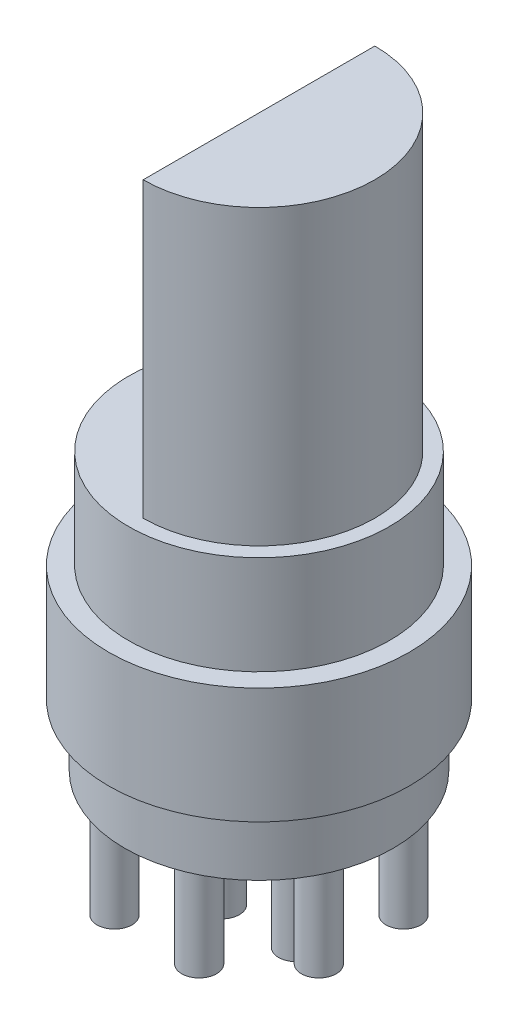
ISO-10303-21;
HEADER;
FILE_DESCRIPTION(('STEP AP214'),'2;1');
FILE_NAME('part.step','',(''),(''),'','','');
FILE_SCHEMA(('AUTOMOTIVE_DESIGN { 1 0 10303 214 1 1 1 1 }'));
ENDSEC;
DATA;
#1=APPLICATION_CONTEXT('core data for automotive mechanical design processes');
#2=APPLICATION_PROTOCOL_DEFINITION('international standard','automotive_design',2000,#1);
#3=PRODUCT_CONTEXT('',#1,'mechanical');
#4=PRODUCT('Part','Part','',(#3));
#5=PRODUCT_RELATED_PRODUCT_CATEGORY('part','',(#4));
#6=PRODUCT_DEFINITION_FORMATION('','',#4);
#7=PRODUCT_DEFINITION_CONTEXT('part definition',#1,'design');
#8=PRODUCT_DEFINITION('design','',#6,#7);
#9=PRODUCT_DEFINITION_SHAPE('','',#8);
#10=(LENGTH_UNIT() NAMED_UNIT(*) SI_UNIT(.MILLI.,.METRE.));
#11=(NAMED_UNIT(*) PLANE_ANGLE_UNIT() SI_UNIT($,.RADIAN.));
#12=(NAMED_UNIT(*) SI_UNIT($,.STERADIAN.) SOLID_ANGLE_UNIT());
#13=UNCERTAINTY_MEASURE_WITH_UNIT(LENGTH_MEASURE(1.E-05),#10,'distance_accuracy_value','');
#14=(GEOMETRIC_REPRESENTATION_CONTEXT(3) GLOBAL_UNCERTAINTY_ASSIGNED_CONTEXT((#13)) GLOBAL_UNIT_ASSIGNED_CONTEXT((#10,
#11,#12)) REPRESENTATION_CONTEXT('',''));
#15=CARTESIAN_POINT('',(0.,0.,0.));
#16=DIRECTION('',(0.,0.,1.));
#17=DIRECTION('',(1.,0.,0.));
#18=AXIS2_PLACEMENT_3D('',#15,#16,#17);
#19=CARTESIAN_POINT('',(0.,-2.1717,0.));
#20=DIRECTION('',(0.,1.,0.));
#21=DIRECTION('',(0.,0.,1.));
#22=AXIS2_PLACEMENT_3D('',#19,#20,#21);
#23=PLANE('',#22);
#24=CARTESIAN_POINT('',(-1.4798942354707,-2.1717,3.57278073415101));
#25=DIRECTION('',(0.,1.,0.));
#26=DIRECTION('',(0.,0.,1.));
#27=AXIS2_PLACEMENT_3D('',#24,#25,#26);
#28=CIRCLE('',#27,0.6096);
#29=CARTESIAN_POINT('',(-1.4798942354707,-2.1717,4.18238073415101));
#30=VERTEX_POINT('',#29);
#31=EDGE_CURVE('E11',#30,#30,#28,.F.);
#32=ORIENTED_EDGE('',*,*,#31,.F.);
#33=EDGE_LOOP('',(#32));
#34=FACE_BOUND('',#33,.T.);
#35=CARTESIAN_POINT('',(1.47989423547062,-2.1717,3.57278073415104));
#36=DIRECTION('',(0.,1.,0.));
#37=DIRECTION('',(0.,0.,1.));
#38=AXIS2_PLACEMENT_3D('',#35,#36,#37);
#39=CIRCLE('',#38,0.6096);
#40=CARTESIAN_POINT('',(1.47989423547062,-2.1717,4.18238073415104));
#41=VERTEX_POINT('',#40);
#42=EDGE_CURVE('E40',#41,#41,#39,.F.);
#43=ORIENTED_EDGE('',*,*,#42,.F.);
#44=EDGE_LOOP('',(#43));
#45=FACE_BOUND('',#44,.T.);
#46=CARTESIAN_POINT('',(3.57278073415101,-2.1717,1.47989423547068));
#47=DIRECTION('',(0.,1.,0.));
#48=DIRECTION('',(0.,0.,1.));
#49=AXIS2_PLACEMENT_3D('',#46,#47,#48);
#50=CIRCLE('',#49,0.6096);
#51=CARTESIAN_POINT('',(3.57278073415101,-2.1717,2.08949423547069));
#52=VERTEX_POINT('',#51);
#53=EDGE_CURVE('E115',#52,#52,#50,.F.);
#54=ORIENTED_EDGE('',*,*,#53,.F.);
#55=EDGE_LOOP('',(#54));
#56=FACE_BOUND('',#55,.T.);
#57=CARTESIAN_POINT('',(3.57278073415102,-2.1717,-1.47989423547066));
#58=DIRECTION('',(0.,1.,0.));
#59=DIRECTION('',(0.,0.,1.));
#60=AXIS2_PLACEMENT_3D('',#57,#58,#59);
#61=CIRCLE('',#60,0.6096);
#62=CARTESIAN_POINT('',(3.57278073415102,-2.1717,-0.87029423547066));
#63=VERTEX_POINT('',#62);
#64=EDGE_CURVE('E112',#63,#63,#61,.F.);
#65=ORIENTED_EDGE('',*,*,#64,.F.);
#66=EDGE_LOOP('',(#65));
#67=FACE_BOUND('',#66,.T.);
#68=CARTESIAN_POINT('',(1.47989423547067,-2.1717,-3.57278073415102));
#69=DIRECTION('',(0.,1.,0.));
#70=DIRECTION('',(0.,0.,1.));
#71=AXIS2_PLACEMENT_3D('',#68,#69,#70);
#72=CIRCLE('',#71,0.6096);
#73=CARTESIAN_POINT('',(1.47989423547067,-2.1717,-2.96318073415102));
#74=VERTEX_POINT('',#73);
#75=EDGE_CURVE('E109',#74,#74,#72,.F.);
#76=ORIENTED_EDGE('',*,*,#75,.F.);
#77=EDGE_LOOP('',(#76));
#78=FACE_BOUND('',#77,.T.);
#79=CARTESIAN_POINT('',(-1.47989423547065,-2.1717,-3.57278073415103));
#80=DIRECTION('',(0.,1.,0.));
#81=DIRECTION('',(0.,0.,1.));
#82=AXIS2_PLACEMENT_3D('',#79,#80,#81);
#83=CIRCLE('',#82,0.6096);
#84=CARTESIAN_POINT('',(-1.47989423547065,-2.1717,-2.96318073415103));
#85=VERTEX_POINT('',#84);
#86=EDGE_CURVE('E106',#85,#85,#83,.F.);
#87=ORIENTED_EDGE('',*,*,#86,.F.);
#88=EDGE_LOOP('',(#87));
#89=FACE_BOUND('',#88,.T.);
#90=CARTESIAN_POINT('',(-3.57278073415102,-2.1717,-1.47989423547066));
#91=DIRECTION('',(0.,1.,0.));
#92=DIRECTION('',(0.,0.,1.));
#93=AXIS2_PLACEMENT_3D('',#90,#91,#92);
#94=CIRCLE('',#93,0.6096);
#95=CARTESIAN_POINT('',(-3.57278073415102,-2.1717,-0.87029423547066));
#96=VERTEX_POINT('',#95);
#97=EDGE_CURVE('E103',#96,#96,#94,.F.);
#98=ORIENTED_EDGE('',*,*,#97,.F.);
#99=EDGE_LOOP('',(#98));
#100=FACE_BOUND('',#99,.T.);
#101=CARTESIAN_POINT('',(-3.57278073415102,-2.1717,1.47989423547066));
#102=DIRECTION('',(0.,1.,0.));
#103=DIRECTION('',(0.,0.,1.));
#104=AXIS2_PLACEMENT_3D('',#101,#102,#103);
#105=CIRCLE('',#104,0.6096);
#106=CARTESIAN_POINT('',(-3.57278073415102,-2.1717,2.08949423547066));
#107=VERTEX_POINT('',#106);
#108=EDGE_CURVE('E100',#107,#107,#105,.F.);
#109=ORIENTED_EDGE('',*,*,#108,.F.);
#110=EDGE_LOOP('',(#109));
#111=FACE_BOUND('',#110,.T.);
#112=CARTESIAN_POINT('',(1.2954,-2.1717,0.));
#113=DIRECTION('',(0.,1.,0.));
#114=DIRECTION('',(0.,0.,1.));
#115=AXIS2_PLACEMENT_3D('',#112,#113,#114);
#116=CIRCLE('',#115,0.6096);
#117=CARTESIAN_POINT('',(1.2954,-2.1717,0.6096));
#118=VERTEX_POINT('',#117);
#119=EDGE_CURVE('E97',#118,#118,#116,.F.);
#120=ORIENTED_EDGE('',*,*,#119,.F.);
#121=EDGE_LOOP('',(#120));
#122=FACE_BOUND('',#121,.T.);
#123=CARTESIAN_POINT('',(-1.2954,-2.1717,0.));
#124=DIRECTION('',(0.,1.,0.));
#125=DIRECTION('',(0.,0.,1.));
#126=AXIS2_PLACEMENT_3D('',#123,#124,#125);
#127=CIRCLE('',#126,0.6096);
#128=CARTESIAN_POINT('',(-1.2954,-2.1717,0.6096));
#129=VERTEX_POINT('',#128);
#130=EDGE_CURVE('E63',#129,#129,#127,.F.);
#131=ORIENTED_EDGE('',*,*,#130,.F.);
#132=EDGE_LOOP('',(#131));
#133=FACE_BOUND('',#132,.T.);
#134=CARTESIAN_POINT('',(0.,-2.1717,0.));
#135=DIRECTION('',(0.,-1.,0.));
#136=DIRECTION('',(0.,0.,-1.));
#137=AXIS2_PLACEMENT_3D('',#134,#135,#136);
#138=CIRCLE('',#137,4.69265);
#139=CARTESIAN_POINT('',(0.,-2.1717,-4.69265));
#140=VERTEX_POINT('',#139);
#141=EDGE_CURVE('E64',#140,#140,#138,.T.);
#142=ORIENTED_EDGE('',*,*,#141,.T.);
#143=EDGE_LOOP('',(#142));
#144=FACE_BOUND('',#143,.T.);
#145=ADVANCED_FACE('F33',(#34,#45,#56,#67,#78,#89,#100,#111,#122,#133,#144),#23,.F.);
#146=CARTESIAN_POINT('',(0.,0.,0.));
#147=DIRECTION('',(0.,-1.,0.));
#148=DIRECTION('',(0.,0.,-1.));
#149=AXIS2_PLACEMENT_3D('',#146,#147,#148);
#150=CYLINDRICAL_SURFACE('',#149,4.69265);
#151=ORIENTED_EDGE('',*,*,#141,.F.);
#152=EDGE_LOOP('',(#151));
#153=FACE_BOUND('',#152,.T.);
#154=CARTESIAN_POINT('',(0.,0.,0.));
#155=DIRECTION('',(0.,-1.,0.));
#156=DIRECTION('',(0.,0.,-1.));
#157=AXIS2_PLACEMENT_3D('',#154,#155,#156);
#158=CIRCLE('',#157,4.69265);
#159=CARTESIAN_POINT('',(0.,0.,-4.69265));
#160=VERTEX_POINT('',#159);
#161=EDGE_CURVE('E90',#160,#160,#158,.T.);
#162=ORIENTED_EDGE('',*,*,#161,.T.);
#163=EDGE_LOOP('',(#162));
#164=FACE_BOUND('',#163,.T.);
#165=ADVANCED_FACE('F124',(#153,#164),#150,.T.);
#166=CARTESIAN_POINT('',(-4.69265,0.,0.));
#167=DIRECTION('',(0.,1.,0.));
#168=DIRECTION('',(0.,0.,1.));
#169=AXIS2_PLACEMENT_3D('',#166,#167,#168);
#170=PLANE('',#169);
#171=ORIENTED_EDGE('',*,*,#161,.F.);
#172=EDGE_LOOP('',(#171));
#173=FACE_BOUND('',#172,.T.);
#174=CARTESIAN_POINT('',(0.,0.,0.));
#175=DIRECTION('',(0.,-1.,0.));
#176=DIRECTION('',(0.,0.,-1.));
#177=AXIS2_PLACEMENT_3D('',#174,#175,#176);
#178=CIRCLE('',#177,5.2578);
#179=CARTESIAN_POINT('',(0.,0.,-5.2578));
#180=VERTEX_POINT('',#179);
#181=EDGE_CURVE('E87',#180,#180,#178,.T.);
#182=ORIENTED_EDGE('',*,*,#181,.T.);
#183=EDGE_LOOP('',(#182));
#184=FACE_BOUND('',#183,.T.);
#185=ADVANCED_FACE('F146',(#173,#184),#170,.F.);
#186=CARTESIAN_POINT('',(0.,0.,0.));
#187=DIRECTION('',(0.,-1.,0.));
#188=DIRECTION('',(0.,0.,-1.));
#189=AXIS2_PLACEMENT_3D('',#186,#187,#188);
#190=CYLINDRICAL_SURFACE('',#189,5.2578);
#191=ORIENTED_EDGE('',*,*,#181,.F.);
#192=EDGE_LOOP('',(#191));
#193=FACE_BOUND('',#192,.T.);
#194=CARTESIAN_POINT('',(0.,4.0513,0.));
#195=DIRECTION('',(0.,-1.,0.));
#196=DIRECTION('',(0.,0.,-1.));
#197=AXIS2_PLACEMENT_3D('',#194,#195,#196);
#198=CIRCLE('',#197,5.2578);
#199=CARTESIAN_POINT('',(0.,4.0513,-5.2578));
#200=VERTEX_POINT('',#199);
#201=EDGE_CURVE('E84',#200,#200,#198,.T.);
#202=ORIENTED_EDGE('',*,*,#201,.T.);
#203=EDGE_LOOP('',(#202));
#204=FACE_BOUND('',#203,.T.);
#205=ADVANCED_FACE('F151',(#193,#204),#190,.T.);
#206=CARTESIAN_POINT('',(-5.2578,4.0513,0.));
#207=DIRECTION('',(0.,-1.,0.));
#208=DIRECTION('',(0.,0.,-1.));
#209=AXIS2_PLACEMENT_3D('',#206,#207,#208);
#210=PLANE('',#209);
#211=ORIENTED_EDGE('',*,*,#201,.F.);
#212=EDGE_LOOP('',(#211));
#213=FACE_BOUND('',#212,.T.);
#214=CARTESIAN_POINT('',(0.,4.0513,0.));
#215=DIRECTION('',(0.,-1.,0.));
#216=DIRECTION('',(0.,0.,-1.));
#217=AXIS2_PLACEMENT_3D('',#214,#215,#216);
#218=CIRCLE('',#217,4.5593);
#219=CARTESIAN_POINT('',(0.,4.0513,-4.5593));
#220=VERTEX_POINT('',#219);
#221=EDGE_CURVE('E81',#220,#220,#218,.T.);
#222=ORIENTED_EDGE('',*,*,#221,.T.);
#223=EDGE_LOOP('',(#222));
#224=FACE_BOUND('',#223,.T.);
#225=ADVANCED_FACE('F157',(#213,#224),#210,.F.);
#226=CARTESIAN_POINT('',(0.,0.,0.));
#227=DIRECTION('',(0.,-1.,0.));
#228=DIRECTION('',(0.,0.,-1.));
#229=AXIS2_PLACEMENT_3D('',#226,#227,#228);
#230=CYLINDRICAL_SURFACE('',#229,4.5593);
#231=ORIENTED_EDGE('',*,*,#221,.F.);
#232=EDGE_LOOP('',(#231));
#233=FACE_BOUND('',#232,.T.);
#234=CARTESIAN_POINT('',(0.,7.5057,0.));
#235=DIRECTION('',(0.,-1.,0.));
#236=DIRECTION('',(0.,0.,-1.));
#237=AXIS2_PLACEMENT_3D('',#234,#235,#236);
#238=CIRCLE('',#237,4.5593);
#239=CARTESIAN_POINT('',(0.,7.5057,-4.5593));
#240=VERTEX_POINT('',#239);
#241=EDGE_CURVE('E75',#240,#240,#238,.T.);
#242=ORIENTED_EDGE('',*,*,#241,.T.);
#243=EDGE_LOOP('',(#242));
#244=FACE_BOUND('',#243,.T.);
#245=ADVANCED_FACE('F163',(#233,#244),#230,.T.);
#246=CARTESIAN_POINT('',(-4.5593,7.5057,0.));
#247=DIRECTION('',(0.,-1.,0.));
#248=DIRECTION('',(0.,0.,-1.));
#249=AXIS2_PLACEMENT_3D('',#246,#247,#248);
#250=PLANE('',#249);
#251=DIRECTION('',(0.,0.,1.));
#252=VECTOR('',#251,1.);
#253=CARTESIAN_POINT('',(0.,7.5057,-5.2578));
#254=LINE('',#253,#252);
#255=CARTESIAN_POINT('',(0.,7.5057,-4.0513));
#256=VERTEX_POINT('',#255);
#257=CARTESIAN_POINT('',(0.,7.5057,4.0513));
#258=VERTEX_POINT('',#257);
#259=EDGE_CURVE('E52',#256,#258,#254,.T.);
#260=ORIENTED_EDGE('',*,*,#259,.F.);
#261=CARTESIAN_POINT('',(0.,7.5057,0.));
#262=DIRECTION('',(0.,-1.,0.));
#263=DIRECTION('',(0.,0.,-1.));
#264=AXIS2_PLACEMENT_3D('',#261,#262,#263);
#265=CIRCLE('',#264,4.0513);
#266=EDGE_CURVE('E71',#256,#258,#265,.T.);
#267=ORIENTED_EDGE('',*,*,#266,.T.);
#268=EDGE_LOOP('',(#260,#267));
#269=FACE_BOUND('',#268,.T.);
#270=ORIENTED_EDGE('',*,*,#241,.F.);
#271=EDGE_LOOP('',(#270));
#272=FACE_BOUND('',#271,.T.);
#273=ADVANCED_FACE('F169',(#269,#272),#250,.F.);
#274=CARTESIAN_POINT('',(0.,0.,0.));
#275=DIRECTION('',(0.,-1.,0.));
#276=DIRECTION('',(0.,0.,-1.));
#277=AXIS2_PLACEMENT_3D('',#274,#275,#276);
#278=CYLINDRICAL_SURFACE('',#277,4.0513);
#279=CARTESIAN_POINT('',(0.,17.7546,0.));
#280=DIRECTION('',(0.,-1.,0.));
#281=DIRECTION('',(0.,0.,-1.));
#282=AXIS2_PLACEMENT_3D('',#279,#280,#281);
#283=CIRCLE('',#282,4.0513);
#284=CARTESIAN_POINT('',(0.,17.7546,-4.0513));
#285=VERTEX_POINT('',#284);
#286=CARTESIAN_POINT('',(0.,17.7546,4.0513));
#287=VERTEX_POINT('',#286);
#288=EDGE_CURVE('E69',#285,#287,#283,.T.);
#289=ORIENTED_EDGE('',*,*,#288,.T.);
#290=DIRECTION('',(0.,-1.,0.));
#291=VECTOR('',#290,1.);
#292=CARTESIAN_POINT('',(0.,0.,4.0513));
#293=LINE('',#292,#291);
#294=EDGE_CURVE('E47',#287,#258,#293,.T.);
#295=ORIENTED_EDGE('',*,*,#294,.T.);
#296=ORIENTED_EDGE('',*,*,#266,.F.);
#297=DIRECTION('',(0.,-1.,0.));
#298=VECTOR('',#297,1.);
#299=CARTESIAN_POINT('',(0.,0.,-4.0513));
#300=LINE('',#299,#298);
#301=EDGE_CURVE('E59',#256,#285,#300,.F.);
#302=ORIENTED_EDGE('',*,*,#301,.T.);
#303=EDGE_LOOP('',(#289,#295,#296,#302));
#304=FACE_BOUND('',#303,.T.);
#305=ADVANCED_FACE('F68',(#304),#278,.T.);
#306=CARTESIAN_POINT('',(-4.0513,17.7546,0.));
#307=DIRECTION('',(0.,-1.,0.));
#308=DIRECTION('',(0.,0.,-1.));
#309=AXIS2_PLACEMENT_3D('',#306,#307,#308);
#310=PLANE('',#309);
#311=ORIENTED_EDGE('',*,*,#288,.F.);
#312=DIRECTION('',(0.,0.,1.));
#313=VECTOR('',#312,1.);
#314=CARTESIAN_POINT('',(0.,17.7546,0.));
#315=LINE('',#314,#313);
#316=EDGE_CURVE('E56',#285,#287,#315,.T.);
#317=ORIENTED_EDGE('',*,*,#316,.T.);
#318=EDGE_LOOP('',(#311,#317));
#319=FACE_BOUND('',#318,.T.);
#320=ADVANCED_FACE('F73',(#319),#310,.F.);
#321=CARTESIAN_POINT('',(0.,17.7546,-5.2578));
#322=DIRECTION('',(1.,0.,0.));
#323=DIRECTION('',(0.,0.,-1.));
#324=AXIS2_PLACEMENT_3D('',#321,#322,#323);
#325=PLANE('',#324);
#326=ORIENTED_EDGE('',*,*,#316,.F.);
#327=ORIENTED_EDGE('',*,*,#301,.F.);
#328=ORIENTED_EDGE('',*,*,#259,.T.);
#329=ORIENTED_EDGE('',*,*,#294,.F.);
#330=EDGE_LOOP('',(#326,#327,#328,#329));
#331=FACE_BOUND('',#330,.T.);
#332=ADVANCED_FACE('F58',(#331),#325,.F.);
#333=CARTESIAN_POINT('',(-1.2954,-6.8707,0.));
#334=DIRECTION('',(0.,1.,0.));
#335=DIRECTION('',(0.,0.,1.));
#336=AXIS2_PLACEMENT_3D('',#333,#334,#335);
#337=CYLINDRICAL_SURFACE('',#336,0.6096);
#338=CARTESIAN_POINT('',(-1.2954,-6.8707,0.));
#339=DIRECTION('',(0.,-1.,0.));
#340=DIRECTION('',(0.,0.,-1.));
#341=AXIS2_PLACEMENT_3D('',#338,#339,#340);
#342=CIRCLE('',#341,0.6096);
#343=CARTESIAN_POINT('',(-1.2954,-6.8707,-0.6096));
#344=VERTEX_POINT('',#343);
#345=EDGE_CURVE('E294',#344,#344,#342,.T.);
#346=ORIENTED_EDGE('',*,*,#345,.F.);
#347=EDGE_LOOP('',(#346));
#348=FACE_BOUND('',#347,.T.);
#349=ORIENTED_EDGE('',*,*,#130,.T.);
#350=EDGE_LOOP('',(#349));
#351=FACE_BOUND('',#350,.T.);
#352=ADVANCED_FACE('F185',(#348,#351),#337,.T.);
#353=CARTESIAN_POINT('',(-1.2954,-6.8707,0.));
#354=DIRECTION('',(0.,-1.,0.));
#355=DIRECTION('',(0.,0.,-1.));
#356=AXIS2_PLACEMENT_3D('',#353,#354,#355);
#357=PLANE('',#356);
#358=ORIENTED_EDGE('',*,*,#345,.T.);
#359=EDGE_LOOP('',(#358));
#360=FACE_BOUND('',#359,.T.);
#361=ADVANCED_FACE('F188',(#360),#357,.T.);
#362=CARTESIAN_POINT('',(1.2954,-6.8707,0.));
#363=DIRECTION('',(0.,1.,0.));
#364=DIRECTION('',(0.,0.,1.));
#365=AXIS2_PLACEMENT_3D('',#362,#363,#364);
#366=CYLINDRICAL_SURFACE('',#365,0.6096);
#367=CARTESIAN_POINT('',(1.2954,-6.8707,0.));
#368=DIRECTION('',(0.,-1.,0.));
#369=DIRECTION('',(0.,0.,-1.));
#370=AXIS2_PLACEMENT_3D('',#367,#368,#369);
#371=CIRCLE('',#370,0.6096);
#372=CARTESIAN_POINT('',(1.2954,-6.8707,-0.6096));
#373=VERTEX_POINT('',#372);
#374=EDGE_CURVE('E291',#373,#373,#371,.T.);
#375=ORIENTED_EDGE('',*,*,#374,.F.);
#376=EDGE_LOOP('',(#375));
#377=FACE_BOUND('',#376,.T.);
#378=ORIENTED_EDGE('',*,*,#119,.T.);
#379=EDGE_LOOP('',(#378));
#380=FACE_BOUND('',#379,.T.);
#381=ADVANCED_FACE('F192',(#377,#380),#366,.T.);
#382=CARTESIAN_POINT('',(1.2954,-6.8707,0.));
#383=DIRECTION('',(0.,-1.,0.));
#384=DIRECTION('',(0.,0.,-1.));
#385=AXIS2_PLACEMENT_3D('',#382,#383,#384);
#386=PLANE('',#385);
#387=ORIENTED_EDGE('',*,*,#374,.T.);
#388=EDGE_LOOP('',(#387));
#389=FACE_BOUND('',#388,.T.);
#390=ADVANCED_FACE('F196',(#389),#386,.T.);
#391=CARTESIAN_POINT('',(-3.57278073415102,-5.4864,1.47989423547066));
#392=DIRECTION('',(0.,1.,0.));
#393=DIRECTION('',(0.,0.,1.));
#394=AXIS2_PLACEMENT_3D('',#391,#392,#393);
#395=CYLINDRICAL_SURFACE('',#394,0.6096);
#396=CARTESIAN_POINT('',(-3.57278073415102,-5.4864,1.47989423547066));
#397=DIRECTION('',(0.,-1.,0.));
#398=DIRECTION('',(0.,0.,-1.));
#399=AXIS2_PLACEMENT_3D('',#396,#397,#398);
#400=CIRCLE('',#399,0.6096);
#401=CARTESIAN_POINT('',(-3.57278073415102,-5.4864,0.87029423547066));
#402=VERTEX_POINT('',#401);
#403=EDGE_CURVE('E288',#402,#402,#400,.T.);
#404=ORIENTED_EDGE('',*,*,#403,.F.);
#405=EDGE_LOOP('',(#404));
#406=FACE_BOUND('',#405,.T.);
#407=ORIENTED_EDGE('',*,*,#108,.T.);
#408=EDGE_LOOP('',(#407));
#409=FACE_BOUND('',#408,.T.);
#410=ADVANCED_FACE('F200',(#406,#409),#395,.T.);
#411=CARTESIAN_POINT('',(-3.57278073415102,-5.4864,1.47989423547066));
#412=DIRECTION('',(0.,-1.,0.));
#413=DIRECTION('',(0.,0.,-1.));
#414=AXIS2_PLACEMENT_3D('',#411,#412,#413);
#415=PLANE('',#414);
#416=ORIENTED_EDGE('',*,*,#403,.T.);
#417=EDGE_LOOP('',(#416));
#418=FACE_BOUND('',#417,.T.);
#419=ADVANCED_FACE('F204',(#418),#415,.T.);
#420=CARTESIAN_POINT('',(-3.57278073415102,-5.4864,-1.47989423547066));
#421=DIRECTION('',(0.,1.,0.));
#422=DIRECTION('',(0.,0.,1.));
#423=AXIS2_PLACEMENT_3D('',#420,#421,#422);
#424=CYLINDRICAL_SURFACE('',#423,0.6096);
#425=CARTESIAN_POINT('',(-3.57278073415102,-5.4864,-1.47989423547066));
#426=DIRECTION('',(0.,-1.,0.));
#427=DIRECTION('',(0.707106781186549,0.,-0.707106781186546));
#428=AXIS2_PLACEMENT_3D('',#425,#426,#427);
#429=CIRCLE('',#428,0.6096);
#430=CARTESIAN_POINT('',(-3.1417284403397,-5.4864,-1.91094652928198));
#431=VERTEX_POINT('',#430);
#432=EDGE_CURVE('E285',#431,#431,#429,.T.);
#433=ORIENTED_EDGE('',*,*,#432,.F.);
#434=EDGE_LOOP('',(#433));
#435=FACE_BOUND('',#434,.T.);
#436=ORIENTED_EDGE('',*,*,#97,.T.);
#437=EDGE_LOOP('',(#436));
#438=FACE_BOUND('',#437,.T.);
#439=ADVANCED_FACE('F208',(#435,#438),#424,.T.);
#440=CARTESIAN_POINT('',(-3.57278073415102,-5.4864,-1.47989423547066));
#441=DIRECTION('',(0.,-1.,0.));
#442=DIRECTION('',(0.707106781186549,0.,-0.707106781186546));
#443=AXIS2_PLACEMENT_3D('',#440,#441,#442);
#444=PLANE('',#443);
#445=ORIENTED_EDGE('',*,*,#432,.T.);
#446=EDGE_LOOP('',(#445));
#447=FACE_BOUND('',#446,.T.);
#448=ADVANCED_FACE('F212',(#447),#444,.T.);
#449=CARTESIAN_POINT('',(-1.47989423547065,-5.4864,-3.57278073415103));
#450=DIRECTION('',(0.,1.,0.));
#451=DIRECTION('',(0.,0.,1.));
#452=AXIS2_PLACEMENT_3D('',#449,#450,#451);
#453=CYLINDRICAL_SURFACE('',#452,0.6096);
#454=CARTESIAN_POINT('',(-1.47989423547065,-5.4864,-3.57278073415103));
#455=DIRECTION('',(0.,-1.,0.));
#456=DIRECTION('',(1.,0.,0.));
#457=AXIS2_PLACEMENT_3D('',#454,#455,#456);
#458=CIRCLE('',#457,0.6096);
#459=CARTESIAN_POINT('',(-0.870294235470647,-5.4864,-3.57278073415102));
#460=VERTEX_POINT('',#459);
#461=EDGE_CURVE('E282',#460,#460,#458,.T.);
#462=ORIENTED_EDGE('',*,*,#461,.F.);
#463=EDGE_LOOP('',(#462));
#464=FACE_BOUND('',#463,.T.);
#465=ORIENTED_EDGE('',*,*,#86,.T.);
#466=EDGE_LOOP('',(#465));
#467=FACE_BOUND('',#466,.T.);
#468=ADVANCED_FACE('F216',(#464,#467),#453,.T.);
#469=CARTESIAN_POINT('',(-1.47989423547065,-5.4864,-3.57278073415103));
#470=DIRECTION('',(0.,-1.,0.));
#471=DIRECTION('',(1.,0.,0.));
#472=AXIS2_PLACEMENT_3D('',#469,#470,#471);
#473=PLANE('',#472);
#474=ORIENTED_EDGE('',*,*,#461,.T.);
#475=EDGE_LOOP('',(#474));
#476=FACE_BOUND('',#475,.T.);
#477=ADVANCED_FACE('F220',(#476),#473,.T.);
#478=CARTESIAN_POINT('',(1.47989423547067,-5.4864,-3.57278073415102));
#479=DIRECTION('',(0.,1.,0.));
#480=DIRECTION('',(0.,0.,1.));
#481=AXIS2_PLACEMENT_3D('',#478,#479,#480);
#482=CYLINDRICAL_SURFACE('',#481,0.6096);
#483=CARTESIAN_POINT('',(1.47989423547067,-5.4864,-3.57278073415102));
#484=DIRECTION('',(0.,-1.,0.));
#485=DIRECTION('',(0.707106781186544,0.,0.707106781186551));
#486=AXIS2_PLACEMENT_3D('',#483,#484,#485);
#487=CIRCLE('',#486,0.6096);
#488=CARTESIAN_POINT('',(1.91094652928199,-5.4864,-3.14172844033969));
#489=VERTEX_POINT('',#488);
#490=EDGE_CURVE('E279',#489,#489,#487,.T.);
#491=ORIENTED_EDGE('',*,*,#490,.F.);
#492=EDGE_LOOP('',(#491));
#493=FACE_BOUND('',#492,.T.);
#494=ORIENTED_EDGE('',*,*,#75,.T.);
#495=EDGE_LOOP('',(#494));
#496=FACE_BOUND('',#495,.T.);
#497=ADVANCED_FACE('F224',(#493,#496),#482,.T.);
#498=CARTESIAN_POINT('',(1.47989423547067,-5.4864,-3.57278073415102));
#499=DIRECTION('',(0.,-1.,0.));
#500=DIRECTION('',(0.707106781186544,0.,0.707106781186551));
#501=AXIS2_PLACEMENT_3D('',#498,#499,#500);
#502=PLANE('',#501);
#503=ORIENTED_EDGE('',*,*,#490,.T.);
#504=EDGE_LOOP('',(#503));
#505=FACE_BOUND('',#504,.T.);
#506=ADVANCED_FACE('F228',(#505),#502,.T.);
#507=CARTESIAN_POINT('',(3.57278073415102,-5.4864,-1.47989423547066));
#508=DIRECTION('',(0.,1.,0.));
#509=DIRECTION('',(0.,0.,1.));
#510=AXIS2_PLACEMENT_3D('',#507,#508,#509);
#511=CYLINDRICAL_SURFACE('',#510,0.6096);
#512=CARTESIAN_POINT('',(3.57278073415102,-5.4864,-1.47989423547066));
#513=DIRECTION('',(0.,-1.,0.));
#514=DIRECTION('',(0.,0.,1.));
#515=AXIS2_PLACEMENT_3D('',#512,#513,#514);
#516=CIRCLE('',#515,0.6096);
#517=CARTESIAN_POINT('',(3.57278073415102,-5.4864,-0.87029423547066));
#518=VERTEX_POINT('',#517);
#519=EDGE_CURVE('E276',#518,#518,#516,.T.);
#520=ORIENTED_EDGE('',*,*,#519,.F.);
#521=EDGE_LOOP('',(#520));
#522=FACE_BOUND('',#521,.T.);
#523=ORIENTED_EDGE('',*,*,#64,.T.);
#524=EDGE_LOOP('',(#523));
#525=FACE_BOUND('',#524,.T.);
#526=ADVANCED_FACE('F232',(#522,#525),#511,.T.);
#527=CARTESIAN_POINT('',(3.57278073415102,-5.4864,-1.47989423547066));
#528=DIRECTION('',(0.,-1.,0.));
#529=DIRECTION('',(0.,0.,1.));
#530=AXIS2_PLACEMENT_3D('',#527,#528,#529);
#531=PLANE('',#530);
#532=ORIENTED_EDGE('',*,*,#519,.T.);
#533=EDGE_LOOP('',(#532));
#534=FACE_BOUND('',#533,.T.);
#535=ADVANCED_FACE('F236',(#534),#531,.T.);
#536=CARTESIAN_POINT('',(3.57278073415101,-5.4864,1.47989423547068));
#537=DIRECTION('',(0.,1.,0.));
#538=DIRECTION('',(0.,0.,1.));
#539=AXIS2_PLACEMENT_3D('',#536,#537,#538);
#540=CYLINDRICAL_SURFACE('',#539,0.6096);
#541=CARTESIAN_POINT('',(3.57278073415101,-5.4864,1.47989423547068));
#542=DIRECTION('',(0.,-1.,0.));
#543=DIRECTION('',(-0.707106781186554,0.,0.707106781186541));
#544=AXIS2_PLACEMENT_3D('',#541,#542,#543);
#545=CIRCLE('',#544,0.6096);
#546=CARTESIAN_POINT('',(3.14172844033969,-5.4864,1.910946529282));
#547=VERTEX_POINT('',#546);
#548=EDGE_CURVE('E271',#547,#547,#545,.T.);
#549=ORIENTED_EDGE('',*,*,#548,.F.);
#550=EDGE_LOOP('',(#549));
#551=FACE_BOUND('',#550,.T.);
#552=ORIENTED_EDGE('',*,*,#53,.T.);
#553=EDGE_LOOP('',(#552));
#554=FACE_BOUND('',#553,.T.);
#555=ADVANCED_FACE('F240',(#551,#554),#540,.T.);
#556=CARTESIAN_POINT('',(3.57278073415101,-5.4864,1.47989423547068));
#557=DIRECTION('',(0.,-1.,0.));
#558=DIRECTION('',(-0.707106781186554,0.,0.707106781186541));
#559=AXIS2_PLACEMENT_3D('',#556,#557,#558);
#560=PLANE('',#559);
#561=ORIENTED_EDGE('',*,*,#548,.T.);
#562=EDGE_LOOP('',(#561));
#563=FACE_BOUND('',#562,.T.);
#564=ADVANCED_FACE('F244',(#563),#560,.T.);
#565=CARTESIAN_POINT('',(1.47989423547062,-5.4864,3.57278073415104));
#566=DIRECTION('',(0.,1.,0.));
#567=DIRECTION('',(0.,0.,1.));
#568=AXIS2_PLACEMENT_3D('',#565,#566,#567);
#569=CYLINDRICAL_SURFACE('',#568,0.6096);
#570=CARTESIAN_POINT('',(1.47989423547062,-5.4864,3.57278073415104));
#571=DIRECTION('',(0.,-1.,0.));
#572=DIRECTION('',(-1.,0.,0.));
#573=AXIS2_PLACEMENT_3D('',#570,#571,#572);
#574=CIRCLE('',#573,0.6096);
#575=CARTESIAN_POINT('',(0.870294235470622,-5.4864,3.57278073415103));
#576=VERTEX_POINT('',#575);
#577=EDGE_CURVE('E268',#576,#576,#574,.T.);
#578=ORIENTED_EDGE('',*,*,#577,.F.);
#579=EDGE_LOOP('',(#578));
#580=FACE_BOUND('',#579,.T.);
#581=ORIENTED_EDGE('',*,*,#42,.T.);
#582=EDGE_LOOP('',(#581));
#583=FACE_BOUND('',#582,.T.);
#584=ADVANCED_FACE('F120',(#580,#583),#569,.T.);
#585=CARTESIAN_POINT('',(1.47989423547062,-5.4864,3.57278073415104));
#586=DIRECTION('',(0.,-1.,0.));
#587=DIRECTION('',(-1.,0.,0.));
#588=AXIS2_PLACEMENT_3D('',#585,#586,#587);
#589=PLANE('',#588);
#590=ORIENTED_EDGE('',*,*,#577,.T.);
#591=EDGE_LOOP('',(#590));
#592=FACE_BOUND('',#591,.T.);
#593=ADVANCED_FACE('F251',(#592),#589,.T.);
#594=CARTESIAN_POINT('',(-1.4798942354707,-5.4864,3.57278073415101));
#595=DIRECTION('',(0.,1.,0.));
#596=DIRECTION('',(0.,0.,1.));
#597=AXIS2_PLACEMENT_3D('',#594,#595,#596);
#598=CYLINDRICAL_SURFACE('',#597,0.6096);
#599=CARTESIAN_POINT('',(-1.4798942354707,-5.4864,3.57278073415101));
#600=DIRECTION('',(0.,-1.,0.));
#601=DIRECTION('',(-0.707106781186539,0.,-0.707106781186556));
#602=AXIS2_PLACEMENT_3D('',#599,#600,#601);
#603=CIRCLE('',#602,0.6096);
#604=CARTESIAN_POINT('',(-1.91094652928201,-5.4864,3.14172844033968));
#605=VERTEX_POINT('',#604);
#606=EDGE_CURVE('E267',#605,#605,#603,.T.);
#607=ORIENTED_EDGE('',*,*,#606,.F.);
#608=EDGE_LOOP('',(#607));
#609=FACE_BOUND('',#608,.T.);
#610=ORIENTED_EDGE('',*,*,#31,.T.);
#611=EDGE_LOOP('',(#610));
#612=FACE_BOUND('',#611,.T.);
#613=ADVANCED_FACE('F255',(#609,#612),#598,.T.);
#614=CARTESIAN_POINT('',(-1.4798942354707,-5.4864,3.57278073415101));
#615=DIRECTION('',(0.,-1.,0.));
#616=DIRECTION('',(-0.707106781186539,0.,-0.707106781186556));
#617=AXIS2_PLACEMENT_3D('',#614,#615,#616);
#618=PLANE('',#617);
#619=ORIENTED_EDGE('',*,*,#606,.T.);
#620=EDGE_LOOP('',(#619));
#621=FACE_BOUND('',#620,.T.);
#622=ADVANCED_FACE('F259',(#621),#618,.T.);
#623=CLOSED_SHELL('',(#145,#165,#185,#205,#225,#245,#273,#305,#320,#332,#352,#361,#381,#390,
#410,#419,#439,#448,#468,#477,#497,#506,#526,#535,#555,#564,#584,#593,#613,#622));
#624=MANIFOLD_SOLID_BREP('B2',#623);
#625=ADVANCED_BREP_SHAPE_REPRESENTATION('',(#18,#624),#14);
#626=SHAPE_DEFINITION_REPRESENTATION(#9,#625);
ENDSEC;
END-ISO-10303-21;
